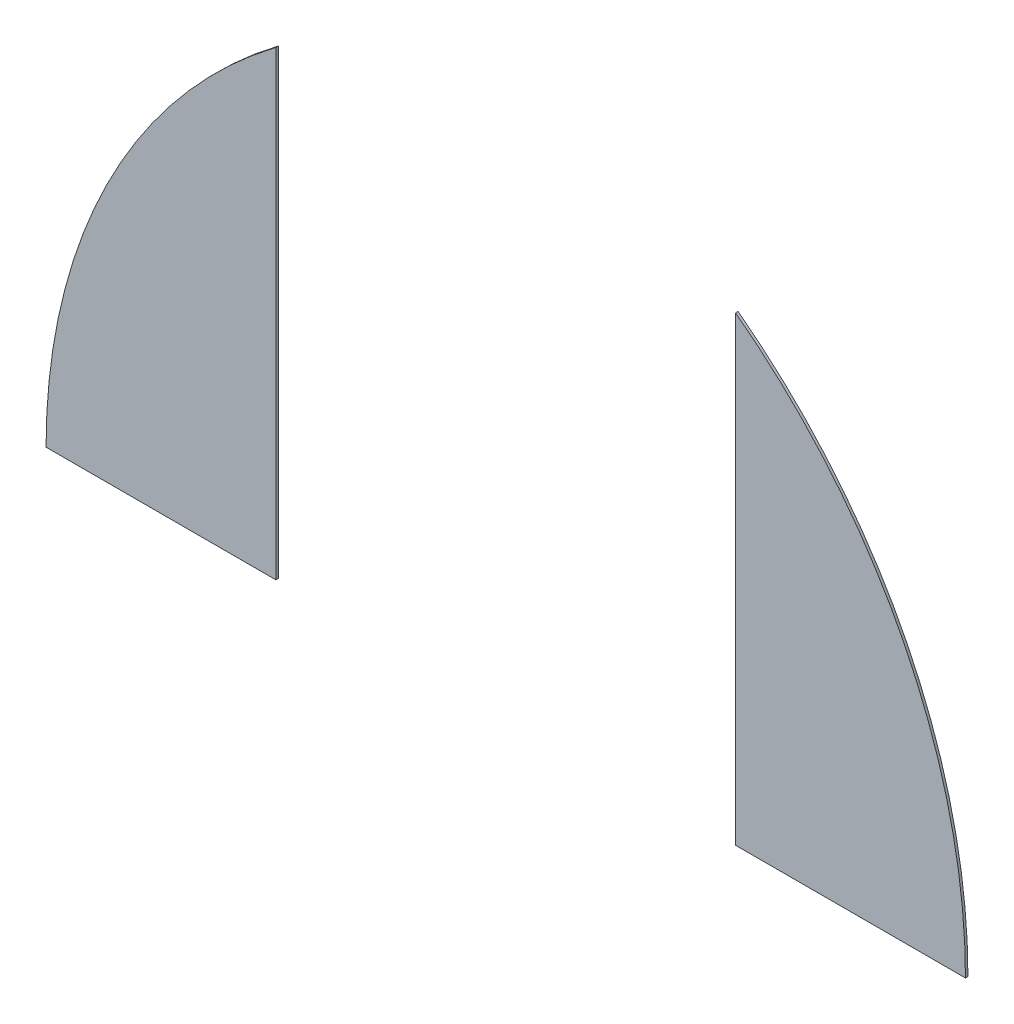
from build123d import *

# Parameters (mm, degrees)
SALIENTE_EXTRUIR1_DEPTH   = 7
SALIENTE_EXTRUIR1_2_DEPTH = 7


with BuildPart() as part:
    # Croquis1 → Saliente-Extruir1 (new body)
    with BuildSketch(Plane.XY):
        with BuildLine():
            Line((-1310.012408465, -678.013291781), (-660.012408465, -678.013291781))
            Line((-660.012408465, -678.013291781), (-660.012408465, 625.998777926))
            ThreePointArc((-660.012408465, 625.998777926), (-1138.50638992, 50.503605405), (-1310.012408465, -678.013291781))
        make_face()
    extrude(amount=SALIENTE_EXTRUIR1_DEPTH)


with BuildPart() as body_2:
    # Croquis1 → Saliente-Extruir1 2 (new body)
    with BuildSketch(Plane.XY):
        with BuildLine():
            Line((639.987591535, 625.998777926), (639.987591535, -678.013291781))
            Line((639.987591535, -678.013291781), (1289.987591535, -678.013291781))
            ThreePointArc((1289.987591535, -678.013291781), (1118.481572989, 50.503605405), (639.987591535, 625.998777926))
        make_face()
    extrude(amount=SALIENTE_EXTRUIR1_2_DEPTH)


solid = Compound([part.part, body_2.part])
